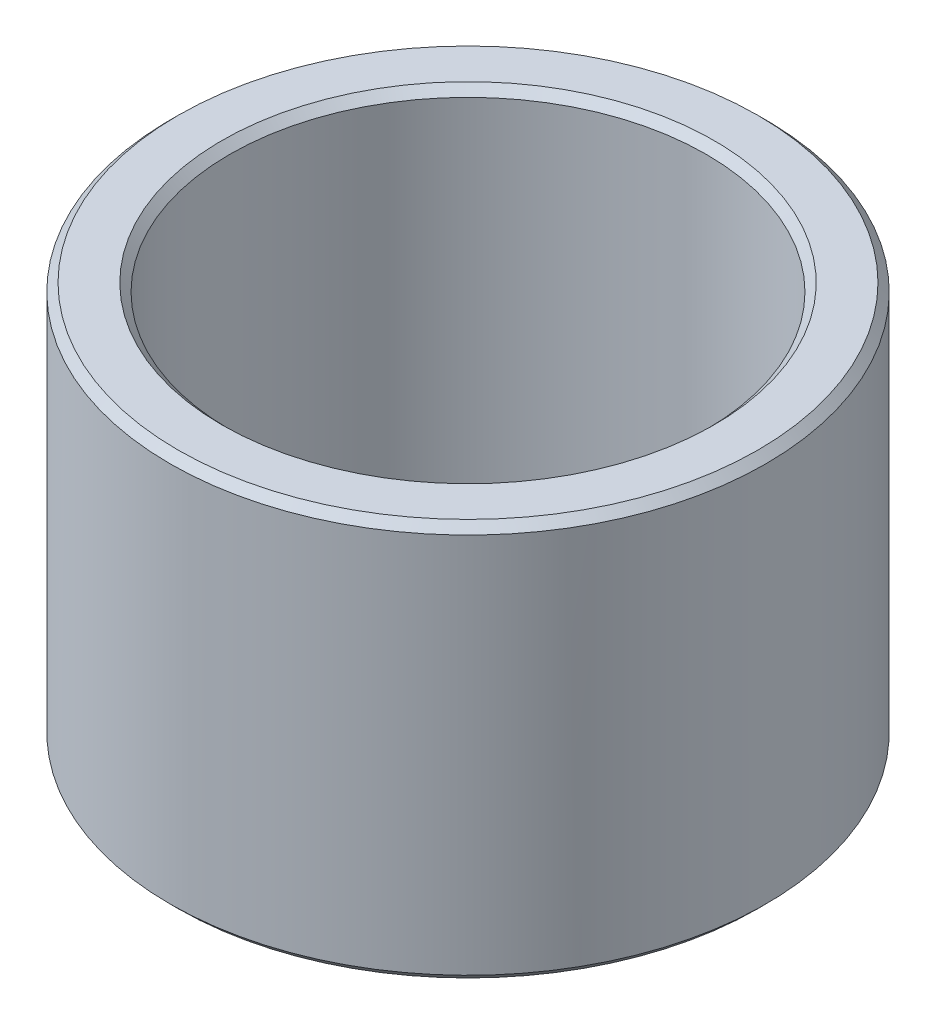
ISO-10303-21;
HEADER;
FILE_DESCRIPTION(('STEP AP214'),'2;1');
FILE_NAME('part.step','',(''),(''),'','','');
FILE_SCHEMA(('AUTOMOTIVE_DESIGN { 1 0 10303 214 1 1 1 1 }'));
ENDSEC;
DATA;
#1=APPLICATION_CONTEXT('core data for automotive mechanical design processes');
#2=APPLICATION_PROTOCOL_DEFINITION('international standard','automotive_design',2000,#1);
#3=PRODUCT_CONTEXT('',#1,'mechanical');
#4=PRODUCT('Part','Part','',(#3));
#5=PRODUCT_RELATED_PRODUCT_CATEGORY('part','',(#4));
#6=PRODUCT_DEFINITION_FORMATION('','',#4);
#7=PRODUCT_DEFINITION_CONTEXT('part definition',#1,'design');
#8=PRODUCT_DEFINITION('design','',#6,#7);
#9=PRODUCT_DEFINITION_SHAPE('','',#8);
#10=(LENGTH_UNIT() NAMED_UNIT(*) SI_UNIT(.MILLI.,.METRE.));
#11=(NAMED_UNIT(*) PLANE_ANGLE_UNIT() SI_UNIT($,.RADIAN.));
#12=(NAMED_UNIT(*) SI_UNIT($,.STERADIAN.) SOLID_ANGLE_UNIT());
#13=UNCERTAINTY_MEASURE_WITH_UNIT(LENGTH_MEASURE(1.E-05),#10,'distance_accuracy_value','');
#14=(GEOMETRIC_REPRESENTATION_CONTEXT(3) GLOBAL_UNCERTAINTY_ASSIGNED_CONTEXT((#13)) GLOBAL_UNIT_ASSIGNED_CONTEXT((#10,
#11,#12)) REPRESENTATION_CONTEXT('',''));
#15=CARTESIAN_POINT('',(0.,0.,0.));
#16=DIRECTION('',(0.,0.,1.));
#17=DIRECTION('',(1.,0.,0.));
#18=AXIS2_PLACEMENT_3D('',#15,#16,#17);
#19=CARTESIAN_POINT('',(0.,0.,0.));
#20=DIRECTION('',(0.,1.,0.));
#21=DIRECTION('',(0.,0.,1.));
#22=AXIS2_PLACEMENT_3D('',#19,#20,#21);
#23=CYLINDRICAL_SURFACE('',#22,6.);
#24=CARTESIAN_POINT('',(0.,9.79999999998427,0.));
#25=DIRECTION('',(0.,1.,0.));
#26=DIRECTION('',(0.,0.,1.));
#27=AXIS2_PLACEMENT_3D('',#24,#25,#26);
#28=CIRCLE('',#27,6.00000000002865);
#29=CARTESIAN_POINT('',(0.,9.79999999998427,6.00000000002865));
#30=VERTEX_POINT('',#29);
#31=EDGE_CURVE('E33',#30,#30,#28,.T.);
#32=ORIENTED_EDGE('',*,*,#31,.T.);
#33=EDGE_LOOP('',(#32));
#34=FACE_BOUND('',#33,.T.);
#35=CARTESIAN_POINT('',(0.,0.199999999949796,0.));
#36=DIRECTION('',(0.,-1.,0.));
#37=DIRECTION('',(0.,0.,-1.));
#38=AXIS2_PLACEMENT_3D('',#35,#36,#37);
#39=CIRCLE('',#38,5.99999999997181);
#40=CARTESIAN_POINT('',(0.,0.199999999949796,-5.99999999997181));
#41=VERTEX_POINT('',#40);
#42=EDGE_CURVE('E36',#41,#41,#39,.T.);
#43=ORIENTED_EDGE('',*,*,#42,.T.);
#44=EDGE_LOOP('',(#43));
#45=FACE_BOUND('',#44,.T.);
#46=ADVANCED_FACE('F14',(#34,#45),#23,.F.);
#47=CARTESIAN_POINT('',(0.,0.,0.));
#48=DIRECTION('',(0.,-1.,0.));
#49=DIRECTION('',(0.,0.,-1.));
#50=AXIS2_PLACEMENT_3D('',#47,#48,#49);
#51=CONICAL_SURFACE('',#50,6.1999999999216,0.785398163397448);
#52=ORIENTED_EDGE('',*,*,#42,.F.);
#53=EDGE_LOOP('',(#52));
#54=FACE_BOUND('',#53,.T.);
#55=CARTESIAN_POINT('',(0.,0.,0.));
#56=DIRECTION('',(0.,-1.,0.));
#57=DIRECTION('',(0.,0.,-1.));
#58=AXIS2_PLACEMENT_3D('',#55,#56,#57);
#59=CIRCLE('',#58,6.1999999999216);
#60=CARTESIAN_POINT('',(0.,0.,-6.1999999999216));
#61=VERTEX_POINT('',#60);
#62=EDGE_CURVE('E17',#61,#61,#59,.T.);
#63=ORIENTED_EDGE('',*,*,#62,.T.);
#64=EDGE_LOOP('',(#63));
#65=FACE_BOUND('',#64,.T.);
#66=ADVANCED_FACE('F54',(#54,#65),#51,.F.);
#67=CARTESIAN_POINT('',(0.,10.0000000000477,0.));
#68=DIRECTION('',(0.,1.,0.));
#69=DIRECTION('',(0.,0.,1.));
#70=AXIS2_PLACEMENT_3D('',#67,#68,#69);
#71=CONICAL_SURFACE('',#70,6.20000000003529,0.785398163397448);
#72=CARTESIAN_POINT('',(0.,10.0000000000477,0.));
#73=DIRECTION('',(0.,1.,0.));
#74=DIRECTION('',(0.,0.,1.));
#75=AXIS2_PLACEMENT_3D('',#72,#73,#74);
#76=CIRCLE('',#75,6.20000000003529);
#77=CARTESIAN_POINT('',(0.,10.0000000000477,6.20000000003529));
#78=VERTEX_POINT('',#77);
#79=EDGE_CURVE('E47',#78,#78,#76,.T.);
#80=ORIENTED_EDGE('',*,*,#79,.T.);
#81=EDGE_LOOP('',(#80));
#82=FACE_BOUND('',#81,.T.);
#83=ORIENTED_EDGE('',*,*,#31,.F.);
#84=EDGE_LOOP('',(#83));
#85=FACE_BOUND('',#84,.T.);
#86=ADVANCED_FACE('F59',(#82,#85),#71,.F.);
#87=CARTESIAN_POINT('',(7.3,0.,0.));
#88=DIRECTION('',(0.,1.,0.));
#89=DIRECTION('',(0.,0.,1.));
#90=AXIS2_PLACEMENT_3D('',#87,#88,#89);
#91=PLANE('',#90);
#92=CARTESIAN_POINT('',(0.,0.,0.));
#93=DIRECTION('',(0.,1.,0.));
#94=DIRECTION('',(-1.,0.,0.));
#95=AXIS2_PLACEMENT_3D('',#92,#93,#94);
#96=CIRCLE('',#95,7.3);
#97=CARTESIAN_POINT('',(-7.3,0.,0.));
#98=VERTEX_POINT('',#97);
#99=EDGE_CURVE('E45',#98,#98,#96,.T.);
#100=ORIENTED_EDGE('',*,*,#99,.F.);
#101=EDGE_LOOP('',(#100));
#102=FACE_BOUND('',#101,.T.);
#103=ORIENTED_EDGE('',*,*,#62,.F.);
#104=EDGE_LOOP('',(#103));
#105=FACE_BOUND('',#104,.T.);
#106=ADVANCED_FACE('F56',(#102,#105),#91,.F.);
#107=CARTESIAN_POINT('',(0.,10.,0.));
#108=DIRECTION('',(0.,-1.,0.));
#109=DIRECTION('',(0.,0.,-1.));
#110=AXIS2_PLACEMENT_3D('',#107,#108,#109);
#111=PLANE('',#110);
#112=ORIENTED_EDGE('',*,*,#79,.F.);
#113=EDGE_LOOP('',(#112));
#114=FACE_BOUND('',#113,.T.);
#115=CARTESIAN_POINT('',(0.,10.,0.));
#116=DIRECTION('',(0.,-1.,0.));
#117=DIRECTION('',(1.,0.,0.));
#118=AXIS2_PLACEMENT_3D('',#115,#116,#117);
#119=CIRCLE('',#118,7.3);
#120=CARTESIAN_POINT('',(7.3,10.,0.));
#121=VERTEX_POINT('',#120);
#122=EDGE_CURVE('E26',#121,#121,#119,.T.);
#123=ORIENTED_EDGE('',*,*,#122,.F.);
#124=EDGE_LOOP('',(#123));
#125=FACE_BOUND('',#124,.T.);
#126=ADVANCED_FACE('F58',(#114,#125),#111,.F.);
#127=CARTESIAN_POINT('',(0.,0.199999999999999,0.));
#128=DIRECTION('',(0.,1.,0.));
#129=DIRECTION('',(-1.,0.,0.));
#130=AXIS2_PLACEMENT_3D('',#127,#128,#129);
#131=CONICAL_SURFACE('',#130,7.5,0.785398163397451);
#132=CARTESIAN_POINT('',(0.,0.199999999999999,0.));
#133=DIRECTION('',(0.,1.,0.));
#134=DIRECTION('',(0.,0.,1.));
#135=AXIS2_PLACEMENT_3D('',#132,#133,#134);
#136=CIRCLE('',#135,7.5);
#137=CARTESIAN_POINT('',(0.,0.199999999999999,7.5));
#138=VERTEX_POINT('',#137);
#139=EDGE_CURVE('E21',#138,#138,#136,.T.);
#140=ORIENTED_EDGE('',*,*,#139,.F.);
#141=EDGE_LOOP('',(#140));
#142=FACE_BOUND('',#141,.T.);
#143=ORIENTED_EDGE('',*,*,#99,.T.);
#144=EDGE_LOOP('',(#143));
#145=FACE_BOUND('',#144,.T.);
#146=ADVANCED_FACE('F67',(#142,#145),#131,.T.);
#147=CARTESIAN_POINT('',(0.,9.8,0.));
#148=DIRECTION('',(0.,-1.,0.));
#149=DIRECTION('',(1.,0.,0.));
#150=AXIS2_PLACEMENT_3D('',#147,#148,#149);
#151=CONICAL_SURFACE('',#150,7.5,0.78539816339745);
#152=ORIENTED_EDGE('',*,*,#122,.T.);
#153=EDGE_LOOP('',(#152));
#154=FACE_BOUND('',#153,.T.);
#155=CARTESIAN_POINT('',(0.,9.8,0.));
#156=DIRECTION('',(0.,1.,0.));
#157=DIRECTION('',(0.,0.,1.));
#158=AXIS2_PLACEMENT_3D('',#155,#156,#157);
#159=CIRCLE('',#158,7.5);
#160=CARTESIAN_POINT('',(0.,9.8,7.5));
#161=VERTEX_POINT('',#160);
#162=EDGE_CURVE('E10',#161,#161,#159,.F.);
#163=ORIENTED_EDGE('',*,*,#162,.F.);
#164=EDGE_LOOP('',(#163));
#165=FACE_BOUND('',#164,.T.);
#166=ADVANCED_FACE('F74',(#154,#165),#151,.T.);
#167=CARTESIAN_POINT('',(0.,0.,0.));
#168=DIRECTION('',(0.,1.,0.));
#169=DIRECTION('',(0.,0.,1.));
#170=AXIS2_PLACEMENT_3D('',#167,#168,#169);
#171=CYLINDRICAL_SURFACE('',#170,7.5);
#172=ORIENTED_EDGE('',*,*,#162,.T.);
#173=EDGE_LOOP('',(#172));
#174=FACE_BOUND('',#173,.T.);
#175=ORIENTED_EDGE('',*,*,#139,.T.);
#176=EDGE_LOOP('',(#175));
#177=FACE_BOUND('',#176,.T.);
#178=ADVANCED_FACE('F72',(#174,#177),#171,.T.);
#179=CLOSED_SHELL('',(#46,#66,#86,#106,#126,#146,#166,#178));
#180=MANIFOLD_SOLID_BREP('B1',#179);
#181=ADVANCED_BREP_SHAPE_REPRESENTATION('',(#18,#180),#14);
#182=SHAPE_DEFINITION_REPRESENTATION(#9,#181);
ENDSEC;
END-ISO-10303-21;
